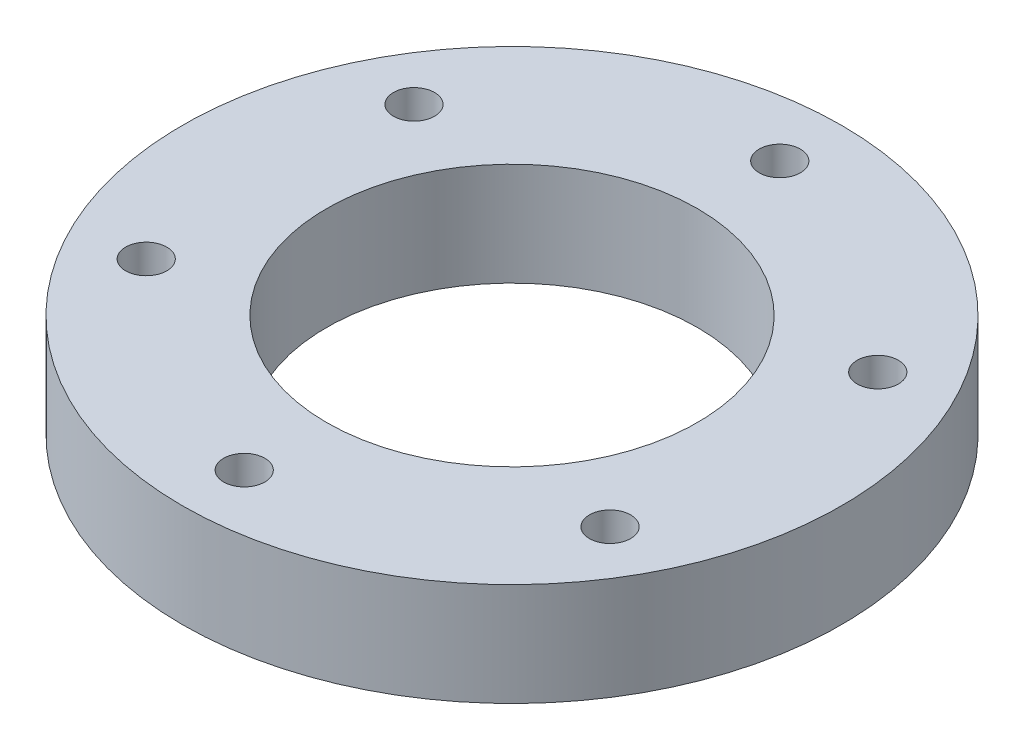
from build123d import *

# Parameters (mm, degrees)
SKETCH1_R           = 20.32
SKETCH1_R_2         = 11.43
SKETCH1_R_3         = 1.27
BOSS_EXTRUDE1_DEPTH = 3.175


with BuildPart() as part:
    # Sketch1 → Boss-Extrude1 (new, symmetric)
    with BuildSketch(Plane(origin=(0, 0, 0), x_dir=(1, 0, 0), z_dir=(0, 1, 0))):
        with Locations(Location((0, 0, 0), (0, 0, 270))):
            Circle(SKETCH1_R)
        with Locations(Location((0, 0, 0), (0, 0, 270))):
            Circle(SKETCH1_R_2, mode=Mode.SUBTRACT)
        with Locations(Location((0, 16.51, 0), (0, 0, 270))):
            Circle(SKETCH1_R_3, mode=Mode.SUBTRACT)
        with Locations(Location((14.298079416, 8.255, 0), (0, 0, 270))):
            Circle(SKETCH1_R_3, mode=Mode.SUBTRACT)
        with Locations(Location((14.298079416, -8.255, 0), (0, 0, 270))):
            Circle(SKETCH1_R_3, mode=Mode.SUBTRACT)
        with Locations(Location((0, -16.51, 0), (0, 0, 270))):
            Circle(SKETCH1_R_3, mode=Mode.SUBTRACT)
        with Locations(Location((-14.298079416, -8.255, 0), (0, 0, 270))):
            Circle(SKETCH1_R_3, mode=Mode.SUBTRACT)
        with Locations(Location((-14.298079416, 8.255, 0), (0, 0, 270))):
            Circle(SKETCH1_R_3, mode=Mode.SUBTRACT)
    extrude(amount=BOSS_EXTRUDE1_DEPTH, both=True)


solid = part.part
